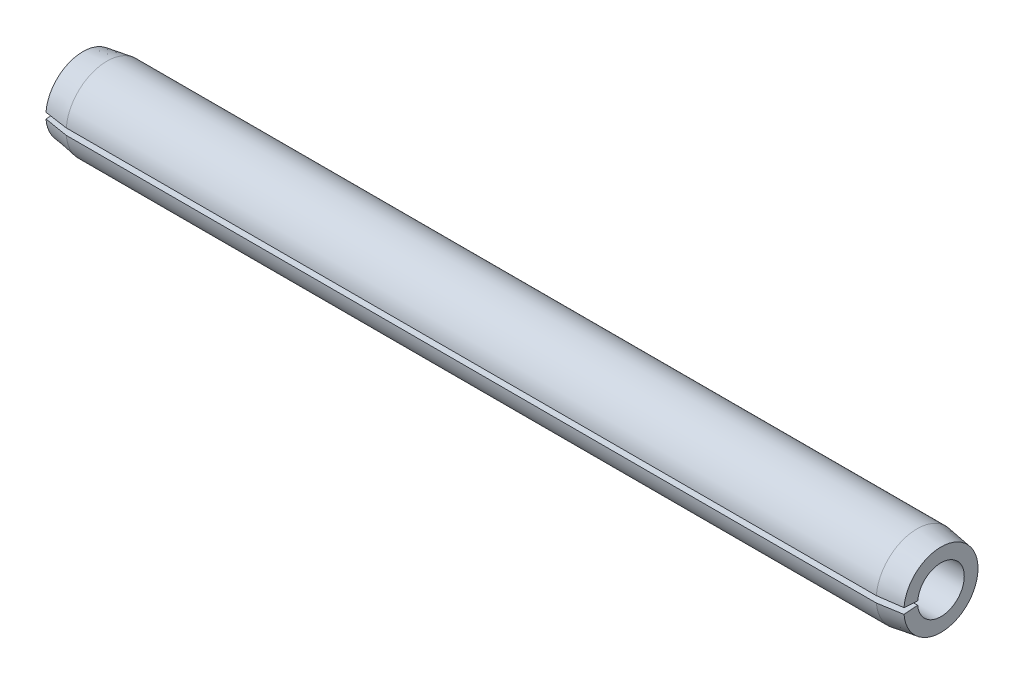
ISO-10303-21;
HEADER;
FILE_DESCRIPTION(('STEP AP214'),'2;1');
FILE_NAME('part.step','',(''),(''),'','','');
FILE_SCHEMA(('AUTOMOTIVE_DESIGN { 1 0 10303 214 1 1 1 1 }'));
ENDSEC;
DATA;
#1=APPLICATION_CONTEXT('core data for automotive mechanical design processes');
#2=APPLICATION_PROTOCOL_DEFINITION('international standard','automotive_design',2000,#1);
#3=PRODUCT_CONTEXT('',#1,'mechanical');
#4=PRODUCT('Part','Part','',(#3));
#5=PRODUCT_RELATED_PRODUCT_CATEGORY('part','',(#4));
#6=PRODUCT_DEFINITION_FORMATION('','',#4);
#7=PRODUCT_DEFINITION_CONTEXT('part definition',#1,'design');
#8=PRODUCT_DEFINITION('design','',#6,#7);
#9=PRODUCT_DEFINITION_SHAPE('','',#8);
#10=(LENGTH_UNIT() NAMED_UNIT(*) SI_UNIT(.MILLI.,.METRE.));
#11=(NAMED_UNIT(*) PLANE_ANGLE_UNIT() SI_UNIT($,.RADIAN.));
#12=(NAMED_UNIT(*) SI_UNIT($,.STERADIAN.) SOLID_ANGLE_UNIT());
#13=UNCERTAINTY_MEASURE_WITH_UNIT(LENGTH_MEASURE(1.E-05),#10,'distance_accuracy_value','');
#14=(GEOMETRIC_REPRESENTATION_CONTEXT(3) GLOBAL_UNCERTAINTY_ASSIGNED_CONTEXT((#13)) GLOBAL_UNIT_ASSIGNED_CONTEXT((#10,
#11,#12)) REPRESENTATION_CONTEXT('',''));
#15=CARTESIAN_POINT('',(0.,0.,0.));
#16=DIRECTION('',(0.,0.,1.));
#17=DIRECTION('',(1.,0.,0.));
#18=AXIS2_PLACEMENT_3D('',#15,#16,#17);
#19=CARTESIAN_POINT('',(0.,2.159,0.));
#20=DIRECTION('',(1.,0.,0.));
#21=DIRECTION('',(0.,0.,-1.));
#22=AXIS2_PLACEMENT_3D('',#19,#20,#21);
#23=PLANE('',#22);
#24=DIRECTION('',(0.,0.0784590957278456,0.996917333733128));
#25=VECTOR('',#24,1.);
#26=CARTESIAN_POINT('',(0.,0.,0.));
#27=LINE('',#26,#25);
#28=CARTESIAN_POINT('',(0.,0.106618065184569,1.35471096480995));
#29=VERTEX_POINT('',#28);
#30=CARTESIAN_POINT('',(0.,0.169393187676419,2.15234452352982));
#31=VERTEX_POINT('',#30);
#32=EDGE_CURVE('E81',#29,#31,#27,.T.);
#33=ORIENTED_EDGE('',*,*,#32,.T.);
#34=CARTESIAN_POINT('',(0.,0.,0.));
#35=DIRECTION('',(-1.,0.,0.));
#36=DIRECTION('',(0.,0.,1.));
#37=AXIS2_PLACEMENT_3D('',#34,#35,#36);
#38=CIRCLE('',#37,2.159);
#39=CARTESIAN_POINT('',(0.,-0.169393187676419,2.15234452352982));
#40=VERTEX_POINT('',#39);
#41=EDGE_CURVE('E99',#31,#40,#38,.T.);
#42=ORIENTED_EDGE('',*,*,#41,.T.);
#43=DIRECTION('',(0.,-0.0784590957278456,0.996917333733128));
#44=VECTOR('',#43,1.);
#45=CARTESIAN_POINT('',(0.,0.,0.));
#46=LINE('',#45,#44);
#47=CARTESIAN_POINT('',(0.,-0.106618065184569,1.35471096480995));
#48=VERTEX_POINT('',#47);
#49=EDGE_CURVE('E53',#48,#40,#46,.T.);
#50=ORIENTED_EDGE('',*,*,#49,.F.);
#51=CARTESIAN_POINT('',(0.,0.,0.));
#52=DIRECTION('',(-1.,0.,0.));
#53=DIRECTION('',(0.,0.,1.));
#54=AXIS2_PLACEMENT_3D('',#51,#52,#53);
#55=CIRCLE('',#54,1.3589);
#56=EDGE_CURVE('E96',#29,#48,#55,.T.);
#57=ORIENTED_EDGE('',*,*,#56,.F.);
#58=EDGE_LOOP('',(#33,#42,#50,#57));
#59=FACE_BOUND('',#58,.T.);
#60=ADVANCED_FACE('F32',(#59),#23,.F.);
#61=CARTESIAN_POINT('',(-9.52499999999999,0.,0.));
#62=DIRECTION('',(-1.,0.,0.));
#63=DIRECTION('',(0.,0.,1.));
#64=AXIS2_PLACEMENT_3D('',#61,#62,#63);
#65=CYLINDRICAL_SURFACE('',#64,1.3589);
#66=DIRECTION('',(-1.,0.,0.));
#67=VECTOR('',#66,1.);
#68=CARTESIAN_POINT('',(-9.52499999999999,0.106618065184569,1.35471096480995));
#69=LINE('',#68,#67);
#70=CARTESIAN_POINT('',(50.,0.106618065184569,1.35471096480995));
#71=VERTEX_POINT('',#70);
#72=EDGE_CURVE('E84',#29,#71,#69,.F.);
#73=ORIENTED_EDGE('',*,*,#72,.F.);
#74=ORIENTED_EDGE('',*,*,#56,.T.);
#75=DIRECTION('',(-1.,0.,0.));
#76=VECTOR('',#75,1.);
#77=CARTESIAN_POINT('',(-9.52499999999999,-0.106618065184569,1.35471096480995));
#78=LINE('',#77,#76);
#79=CARTESIAN_POINT('',(50.,-0.106618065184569,1.35471096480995));
#80=VERTEX_POINT('',#79);
#81=EDGE_CURVE('E117',#48,#80,#78,.F.);
#82=ORIENTED_EDGE('',*,*,#81,.T.);
#83=CARTESIAN_POINT('',(50.,0.,0.));
#84=DIRECTION('',(-1.,0.,0.));
#85=DIRECTION('',(0.,0.,1.));
#86=AXIS2_PLACEMENT_3D('',#83,#84,#85);
#87=CIRCLE('',#86,1.3589);
#88=EDGE_CURVE('E98',#71,#80,#87,.T.);
#89=ORIENTED_EDGE('',*,*,#88,.F.);
#90=EDGE_LOOP('',(#73,#74,#82,#89));
#91=FACE_BOUND('',#90,.T.);
#92=ADVANCED_FACE('F94',(#91),#65,.F.);
#93=CARTESIAN_POINT('',(50.,1.3589,0.));
#94=DIRECTION('',(-1.,0.,0.));
#95=DIRECTION('',(0.,0.,1.));
#96=AXIS2_PLACEMENT_3D('',#93,#94,#95);
#97=PLANE('',#96);
#98=DIRECTION('',(0.,0.0784590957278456,0.996917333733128));
#99=VECTOR('',#98,1.);
#100=CARTESIAN_POINT('',(50.,0.,0.));
#101=LINE('',#100,#99);
#102=CARTESIAN_POINT('',(50.,0.169393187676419,2.15234452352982));
#103=VERTEX_POINT('',#102);
#104=EDGE_CURVE('E126',#71,#103,#101,.T.);
#105=ORIENTED_EDGE('',*,*,#104,.F.);
#106=ORIENTED_EDGE('',*,*,#88,.T.);
#107=DIRECTION('',(0.,-0.0784590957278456,0.996917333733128));
#108=VECTOR('',#107,1.);
#109=CARTESIAN_POINT('',(50.,0.,0.));
#110=LINE('',#109,#108);
#111=CARTESIAN_POINT('',(50.,-0.169393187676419,2.15234452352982));
#112=VERTEX_POINT('',#111);
#113=EDGE_CURVE('E125',#80,#112,#110,.T.);
#114=ORIENTED_EDGE('',*,*,#113,.T.);
#115=CARTESIAN_POINT('',(50.,0.,0.));
#116=DIRECTION('',(-1.,0.,0.));
#117=DIRECTION('',(0.,0.,1.));
#118=AXIS2_PLACEMENT_3D('',#115,#116,#117);
#119=CIRCLE('',#118,2.159);
#120=EDGE_CURVE('E103',#103,#112,#119,.T.);
#121=ORIENTED_EDGE('',*,*,#120,.F.);
#122=EDGE_LOOP('',(#105,#106,#114,#121));
#123=FACE_BOUND('',#122,.T.);
#124=ADVANCED_FACE('F136',(#123),#97,.F.);
#125=CARTESIAN_POINT('',(50.,0.,0.));
#126=DIRECTION('',(-1.,0.,0.));
#127=DIRECTION('',(0.,0.,1.));
#128=AXIS2_PLACEMENT_3D('',#125,#126,#127);
#129=CONICAL_SURFACE('',#128,2.159,0.153332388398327);
#130=DIRECTION('',(-0.988267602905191,0.0119832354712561,0.15226144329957));
#131=VECTOR('',#130,1.);
#132=CARTESIAN_POINT('',(63.9699999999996,0.,0.));
#133=LINE('',#132,#131);
#134=CARTESIAN_POINT('',(48.603,0.186332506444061,2.36757897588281));
#135=VERTEX_POINT('',#134);
#136=EDGE_CURVE('E100',#103,#135,#133,.T.);
#137=ORIENTED_EDGE('',*,*,#136,.F.);
#138=ORIENTED_EDGE('',*,*,#120,.T.);
#139=DIRECTION('',(-0.988267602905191,-0.0119832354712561,0.15226144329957));
#140=VECTOR('',#139,1.);
#141=CARTESIAN_POINT('',(63.9699999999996,0.,0.));
#142=LINE('',#141,#140);
#143=CARTESIAN_POINT('',(48.603,-0.186332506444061,2.36757897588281));
#144=VERTEX_POINT('',#143);
#145=EDGE_CURVE('E119',#112,#144,#142,.T.);
#146=ORIENTED_EDGE('',*,*,#145,.T.);
#147=CARTESIAN_POINT('',(48.603,0.,0.));
#148=DIRECTION('',(-1.,0.,0.));
#149=DIRECTION('',(0.,0.,1.));
#150=AXIS2_PLACEMENT_3D('',#147,#148,#149);
#151=CIRCLE('',#150,2.37490000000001);
#152=EDGE_CURVE('E108',#135,#144,#151,.T.);
#153=ORIENTED_EDGE('',*,*,#152,.F.);
#154=EDGE_LOOP('',(#137,#138,#146,#153));
#155=FACE_BOUND('',#154,.T.);
#156=ADVANCED_FACE('F135',(#155),#129,.T.);
#157=CARTESIAN_POINT('',(-9.52499999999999,0.,0.));
#158=DIRECTION('',(-1.,0.,0.));
#159=DIRECTION('',(0.,0.,1.));
#160=AXIS2_PLACEMENT_3D('',#157,#158,#159);
#161=CYLINDRICAL_SURFACE('',#160,2.3749);
#162=DIRECTION('',(-1.,0.,0.));
#163=VECTOR('',#162,1.);
#164=CARTESIAN_POINT('',(-9.52499999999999,0.186332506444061,2.36757897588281));
#165=LINE('',#164,#163);
#166=CARTESIAN_POINT('',(1.397,0.186332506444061,2.36757897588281));
#167=VERTEX_POINT('',#166);
#168=EDGE_CURVE('E45',#135,#167,#165,.T.);
#169=ORIENTED_EDGE('',*,*,#168,.F.);
#170=ORIENTED_EDGE('',*,*,#152,.T.);
#171=DIRECTION('',(-1.,0.,0.));
#172=VECTOR('',#171,1.);
#173=CARTESIAN_POINT('',(-9.52499999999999,-0.186332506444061,2.36757897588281));
#174=LINE('',#173,#172);
#175=CARTESIAN_POINT('',(1.397,-0.186332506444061,2.36757897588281));
#176=VERTEX_POINT('',#175);
#177=EDGE_CURVE('E122',#144,#176,#174,.T.);
#178=ORIENTED_EDGE('',*,*,#177,.T.);
#179=CARTESIAN_POINT('',(1.397,0.,0.));
#180=DIRECTION('',(-1.,0.,0.));
#181=DIRECTION('',(0.,0.,1.));
#182=AXIS2_PLACEMENT_3D('',#179,#180,#181);
#183=CIRCLE('',#182,2.3749);
#184=EDGE_CURVE('E111',#167,#176,#183,.T.);
#185=ORIENTED_EDGE('',*,*,#184,.F.);
#186=EDGE_LOOP('',(#169,#170,#178,#185));
#187=FACE_BOUND('',#186,.T.);
#188=ADVANCED_FACE('F139',(#187),#161,.T.);
#189=CARTESIAN_POINT('',(1.397,0.,0.));
#190=DIRECTION('',(1.,0.,0.));
#191=DIRECTION('',(0.,0.,-1.));
#192=AXIS2_PLACEMENT_3D('',#189,#190,#191);
#193=CONICAL_SURFACE('',#192,2.3749,0.153332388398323);
#194=DIRECTION('',(-0.988267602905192,-0.0119832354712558,-0.152261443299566));
#195=VECTOR('',#194,1.);
#196=CARTESIAN_POINT('',(-13.97,0.,0.));
#197=LINE('',#196,#195);
#198=EDGE_CURVE('E11',#167,#31,#197,.T.);
#199=ORIENTED_EDGE('',*,*,#198,.F.);
#200=ORIENTED_EDGE('',*,*,#184,.T.);
#201=DIRECTION('',(-0.988267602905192,0.0119832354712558,-0.152261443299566));
#202=VECTOR('',#201,1.);
#203=CARTESIAN_POINT('',(-13.97,0.,0.));
#204=LINE('',#203,#202);
#205=EDGE_CURVE('E39',#176,#40,#204,.T.);
#206=ORIENTED_EDGE('',*,*,#205,.T.);
#207=ORIENTED_EDGE('',*,*,#41,.F.);
#208=EDGE_LOOP('',(#199,#200,#206,#207));
#209=FACE_BOUND('',#208,.T.);
#210=ADVANCED_FACE('F142',(#209),#193,.T.);
#211=CARTESIAN_POINT('',(50.,0.,0.));
#212=DIRECTION('',(0.,-0.996917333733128,-0.0784590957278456));
#213=DIRECTION('',(0.,0.0784590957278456,-0.996917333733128));
#214=AXIS2_PLACEMENT_3D('',#211,#212,#213);
#215=PLANE('',#214);
#216=ORIENTED_EDGE('',*,*,#49,.T.);
#217=ORIENTED_EDGE('',*,*,#205,.F.);
#218=ORIENTED_EDGE('',*,*,#177,.F.);
#219=ORIENTED_EDGE('',*,*,#145,.F.);
#220=ORIENTED_EDGE('',*,*,#113,.F.);
#221=ORIENTED_EDGE('',*,*,#81,.F.);
#222=EDGE_LOOP('',(#216,#217,#218,#219,#220,#221));
#223=FACE_BOUND('',#222,.T.);
#224=ADVANCED_FACE('F137',(#223),#215,.F.);
#225=CARTESIAN_POINT('',(50.,0.,0.));
#226=DIRECTION('',(0.,-0.996917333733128,0.0784590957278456));
#227=DIRECTION('',(0.,-0.0784590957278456,-0.996917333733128));
#228=AXIS2_PLACEMENT_3D('',#225,#226,#227);
#229=PLANE('',#228);
#230=ORIENTED_EDGE('',*,*,#72,.T.);
#231=ORIENTED_EDGE('',*,*,#104,.T.);
#232=ORIENTED_EDGE('',*,*,#136,.T.);
#233=ORIENTED_EDGE('',*,*,#168,.T.);
#234=ORIENTED_EDGE('',*,*,#198,.T.);
#235=ORIENTED_EDGE('',*,*,#32,.F.);
#236=EDGE_LOOP('',(#230,#231,#232,#233,#234,#235));
#237=FACE_BOUND('',#236,.T.);
#238=ADVANCED_FACE('F83',(#237),#229,.T.);
#239=CLOSED_SHELL('',(#60,#92,#124,#156,#188,#210,#224,#238));
#240=MANIFOLD_SOLID_BREP('B2',#239);
#241=ADVANCED_BREP_SHAPE_REPRESENTATION('',(#18,#240),#14);
#242=SHAPE_DEFINITION_REPRESENTATION(#9,#241);
ENDSEC;
END-ISO-10303-21;
